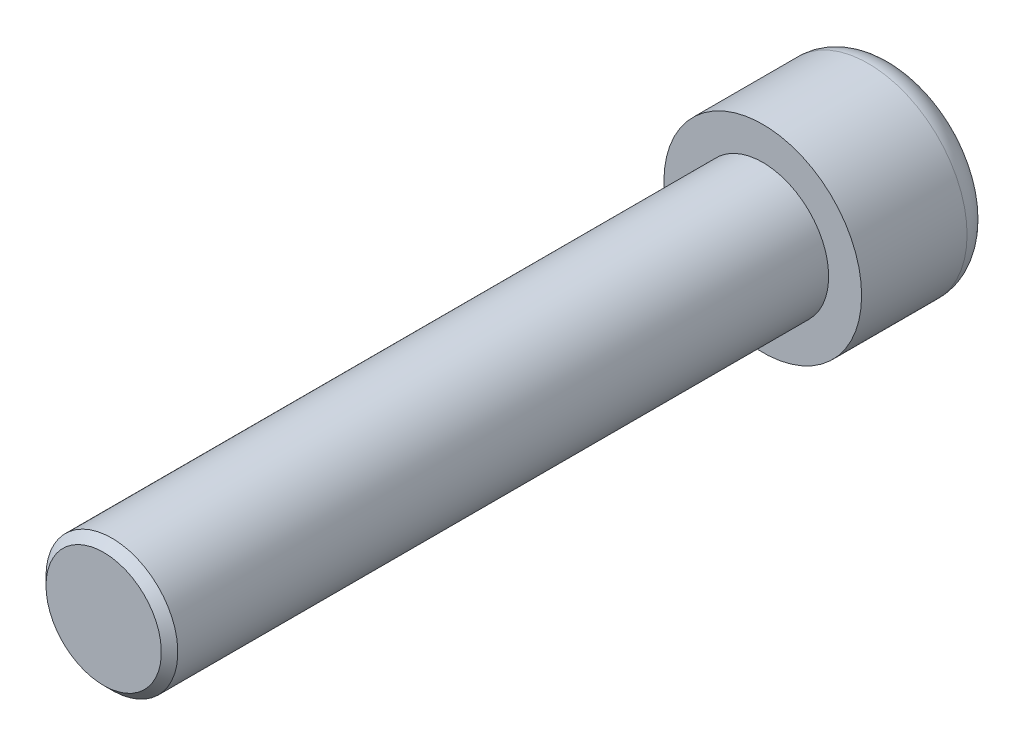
from build123d import *

# Parameters (mm, degrees)
PROFIL_T_TE_R         = 12
TETE_DEPTH            = 16
SIX_PANS_DEPTH        = 10
CONGE_R               = 3.2
PROFIL_CYLINDRE_R     = 8
CYLINDRE_FILETE_DEPTH = 80


with BuildPart() as part:
    # profil t_te → TETE (new body)
    with BuildSketch(Plane.XY):
        Circle(PROFIL_T_TE_R)
    extrude(amount=TETE_DEPTH)

    # profil six pans → SIX PANS (cut)
    with BuildSketch(Plane(origin=(0, 0, 0), x_dir=(-1, 0, 0), z_dir=(0, 0, -1))):
        Polygon((0, 8.082903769), (-7, 4.041451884), (-7, -4.041451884), (0, -8.082903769), (7, -4.041451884), (7, 4.041451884), align=None)
    extrude(amount=-SIX_PANS_DEPTH, mode=Mode.SUBTRACT)

    # CONGE
    conge_edges = [part.edges().sort_by_distance(p)[0] for p in [
        (-12, 0, 0),
    ]]
    fillet(conge_edges, radius=CONGE_R)

    # profil cylindre → CYLINDRE FILETE (add)
    with BuildSketch(Plane.XY.offset(16)):
        Circle(PROFIL_CYLINDRE_R)
    extrude(amount=CYLINDRE_FILETE_DEPTH)

    # profil chanfrein → CHANFREIN FILET (revolve, cut)
    with BuildSketch(Plane(origin=(0, 0, 0), x_dir=(0, 0, -1), z_dir=(1, 0, 0)), mode=Mode.PRIVATE) as chanfrein_filet_sk:
        Polygon((-96, 7), (-95, 8), (-96, 8), align=None)
    revolve(chanfrein_filet_sk.sketch.rotate(Axis((0, 0, 12.087417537), (0, 0, 1)), 90), axis=Axis((0, 0, 12.087417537), (0, 0, 1)), mode=Mode.SUBTRACT)


solid = part.part
